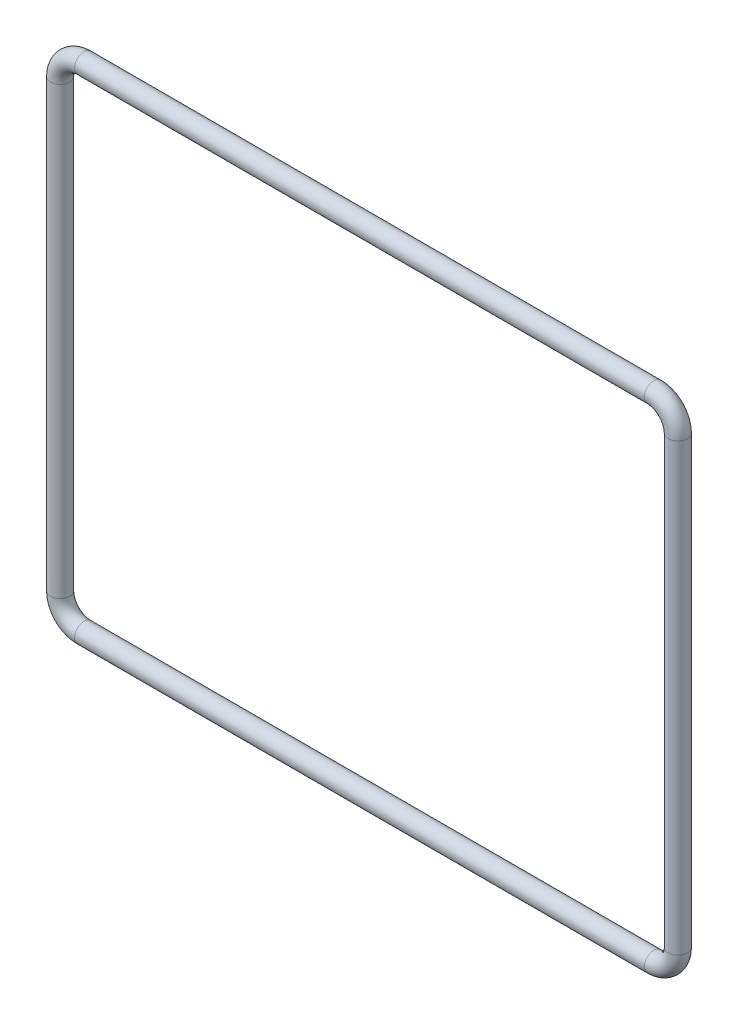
ISO-10303-21;
HEADER;
FILE_DESCRIPTION(('STEP AP214'),'2;1');
FILE_NAME('part.step','',(''),(''),'','','');
FILE_SCHEMA(('AUTOMOTIVE_DESIGN { 1 0 10303 214 1 1 1 1 }'));
ENDSEC;
DATA;
#1=APPLICATION_CONTEXT('core data for automotive mechanical design processes');
#2=APPLICATION_PROTOCOL_DEFINITION('international standard','automotive_design',2000,#1);
#3=PRODUCT_CONTEXT('',#1,'mechanical');
#4=PRODUCT('Part','Part','',(#3));
#5=PRODUCT_RELATED_PRODUCT_CATEGORY('part','',(#4));
#6=PRODUCT_DEFINITION_FORMATION('','',#4);
#7=PRODUCT_DEFINITION_CONTEXT('part definition',#1,'design');
#8=PRODUCT_DEFINITION('design','',#6,#7);
#9=PRODUCT_DEFINITION_SHAPE('','',#8);
#10=(LENGTH_UNIT() NAMED_UNIT(*) SI_UNIT(.MILLI.,.METRE.));
#11=(NAMED_UNIT(*) PLANE_ANGLE_UNIT() SI_UNIT($,.RADIAN.));
#12=(NAMED_UNIT(*) SI_UNIT($,.STERADIAN.) SOLID_ANGLE_UNIT());
#13=UNCERTAINTY_MEASURE_WITH_UNIT(LENGTH_MEASURE(1.E-05),#10,'distance_accuracy_value','');
#14=(GEOMETRIC_REPRESENTATION_CONTEXT(3) GLOBAL_UNCERTAINTY_ASSIGNED_CONTEXT((#13)) GLOBAL_UNIT_ASSIGNED_CONTEXT((#10,
#11,#12)) REPRESENTATION_CONTEXT('',''));
#15=CARTESIAN_POINT('',(0.,0.,0.));
#16=DIRECTION('',(0.,0.,1.));
#17=DIRECTION('',(1.,0.,0.));
#18=AXIS2_PLACEMENT_3D('',#15,#16,#17);
#19=CARTESIAN_POINT('',(0.,-107.,-23.));
#20=DIRECTION('',(-1.,0.,0.));
#21=DIRECTION('',(0.,0.,1.));
#22=AXIS2_PLACEMENT_3D('',#19,#20,#21);
#23=CYLINDRICAL_SURFACE('',#22,2.);
#24=CARTESIAN_POINT('',(-59.5,-107.,-23.));
#25=DIRECTION('',(-1.,0.,0.));
#26=DIRECTION('',(0.,-1.,0.));
#27=AXIS2_PLACEMENT_3D('',#24,#25,#26);
#28=CIRCLE('',#27,2.);
#29=CARTESIAN_POINT('',(-59.5,-109.,-23.));
#30=VERTEX_POINT('',#29);
#31=EDGE_CURVE('E69',#30,#30,#28,.T.);
#32=ORIENTED_EDGE('',*,*,#31,.F.);
#33=EDGE_LOOP('',(#32));
#34=FACE_BOUND('',#33,.T.);
#35=CARTESIAN_POINT('',(59.5,-107.,-23.));
#36=DIRECTION('',(-1.,0.,0.));
#37=DIRECTION('',(0.,-1.,0.));
#38=AXIS2_PLACEMENT_3D('',#35,#36,#37);
#39=CIRCLE('',#38,2.);
#40=CARTESIAN_POINT('',(59.5,-109.,-23.));
#41=VERTEX_POINT('',#40);
#42=EDGE_CURVE('E86',#41,#41,#39,.F.);
#43=ORIENTED_EDGE('',*,*,#42,.F.);
#44=EDGE_LOOP('',(#43));
#45=FACE_BOUND('',#44,.T.);
#46=ADVANCED_FACE('F14',(#34,#45),#23,.T.);
#47=CARTESIAN_POINT('',(59.5,-102.,-23.));
#48=DIRECTION('',(0.,0.,-1.));
#49=DIRECTION('',(-1.,0.,0.));
#50=AXIS2_PLACEMENT_3D('',#47,#48,#49);
#51=TOROIDAL_SURFACE('',#50,5.,2.);
#52=CARTESIAN_POINT('',(64.5,-102.,-23.));
#53=DIRECTION('',(0.,1.,0.));
#54=DIRECTION('',(0.,0.,1.));
#55=AXIS2_PLACEMENT_3D('',#52,#53,#54);
#56=CIRCLE('',#55,2.);
#57=CARTESIAN_POINT('',(64.5,-102.,-21.));
#58=VERTEX_POINT('',#57);
#59=EDGE_CURVE('E63',#58,#58,#56,.T.);
#60=ORIENTED_EDGE('',*,*,#59,.F.);
#61=EDGE_LOOP('',(#60));
#62=FACE_BOUND('',#61,.T.);
#63=ORIENTED_EDGE('',*,*,#42,.T.);
#64=EDGE_LOOP('',(#63));
#65=FACE_BOUND('',#64,.T.);
#66=ADVANCED_FACE('F79',(#62,#65),#51,.T.);
#67=CARTESIAN_POINT('',(-59.5,-102.,-23.));
#68=DIRECTION('',(0.,0.,-1.));
#69=DIRECTION('',(-1.,0.,0.));
#70=AXIS2_PLACEMENT_3D('',#67,#68,#69);
#71=TOROIDAL_SURFACE('',#70,5.,2.);
#72=ORIENTED_EDGE('',*,*,#31,.T.);
#73=EDGE_LOOP('',(#72));
#74=FACE_BOUND('',#73,.T.);
#75=CARTESIAN_POINT('',(-64.5,-102.,-23.));
#76=DIRECTION('',(0.,1.,0.));
#77=DIRECTION('',(0.,0.,1.));
#78=AXIS2_PLACEMENT_3D('',#75,#76,#77);
#79=CIRCLE('',#78,2.);
#80=CARTESIAN_POINT('',(-64.5,-102.,-21.));
#81=VERTEX_POINT('',#80);
#82=EDGE_CURVE('E58',#81,#81,#79,.T.);
#83=ORIENTED_EDGE('',*,*,#82,.F.);
#84=EDGE_LOOP('',(#83));
#85=FACE_BOUND('',#84,.T.);
#86=ADVANCED_FACE('F76',(#74,#85),#71,.T.);
#87=CARTESIAN_POINT('',(64.5,-55.5,-23.));
#88=DIRECTION('',(0.,1.,0.));
#89=DIRECTION('',(0.,0.,1.));
#90=AXIS2_PLACEMENT_3D('',#87,#88,#89);
#91=CYLINDRICAL_SURFACE('',#90,2.);
#92=CARTESIAN_POINT('',(64.5,-9.,-23.));
#93=DIRECTION('',(0.,-1.,0.));
#94=DIRECTION('',(1.,0.,0.));
#95=AXIS2_PLACEMENT_3D('',#92,#93,#94);
#96=CIRCLE('',#95,2.);
#97=CARTESIAN_POINT('',(66.5,-9.,-23.));
#98=VERTEX_POINT('',#97);
#99=EDGE_CURVE('E54',#98,#98,#96,.F.);
#100=ORIENTED_EDGE('',*,*,#99,.F.);
#101=EDGE_LOOP('',(#100));
#102=FACE_BOUND('',#101,.T.);
#103=ORIENTED_EDGE('',*,*,#59,.T.);
#104=EDGE_LOOP('',(#103));
#105=FACE_BOUND('',#104,.T.);
#106=ADVANCED_FACE('F78',(#102,#105),#91,.T.);
#107=CARTESIAN_POINT('',(-64.5,-55.5,-23.));
#108=DIRECTION('',(0.,1.,0.));
#109=DIRECTION('',(0.,0.,1.));
#110=AXIS2_PLACEMENT_3D('',#107,#108,#109);
#111=CYLINDRICAL_SURFACE('',#110,2.);
#112=CARTESIAN_POINT('',(-64.5,-9.,-23.));
#113=DIRECTION('',(0.,1.,0.));
#114=DIRECTION('',(-1.,0.,0.));
#115=AXIS2_PLACEMENT_3D('',#112,#113,#114);
#116=CIRCLE('',#115,2.);
#117=CARTESIAN_POINT('',(-66.5,-9.,-23.));
#118=VERTEX_POINT('',#117);
#119=EDGE_CURVE('E27',#118,#118,#116,.T.);
#120=ORIENTED_EDGE('',*,*,#119,.F.);
#121=EDGE_LOOP('',(#120));
#122=FACE_BOUND('',#121,.T.);
#123=ORIENTED_EDGE('',*,*,#82,.T.);
#124=EDGE_LOOP('',(#123));
#125=FACE_BOUND('',#124,.T.);
#126=ADVANCED_FACE('F48',(#122,#125),#111,.T.);
#127=CARTESIAN_POINT('',(59.5,-9.,-23.));
#128=DIRECTION('',(0.,0.,-1.));
#129=DIRECTION('',(-1.,0.,0.));
#130=AXIS2_PLACEMENT_3D('',#127,#128,#129);
#131=TOROIDAL_SURFACE('',#130,5.,2.);
#132=CARTESIAN_POINT('',(59.5,-4.,-23.));
#133=DIRECTION('',(-1.,0.,0.));
#134=DIRECTION('',(0.,0.,1.));
#135=AXIS2_PLACEMENT_3D('',#132,#133,#134);
#136=CIRCLE('',#135,2.);
#137=CARTESIAN_POINT('',(59.5,-4.,-21.));
#138=VERTEX_POINT('',#137);
#139=EDGE_CURVE('E21',#138,#138,#136,.T.);
#140=ORIENTED_EDGE('',*,*,#139,.F.);
#141=EDGE_LOOP('',(#140));
#142=FACE_BOUND('',#141,.T.);
#143=ORIENTED_EDGE('',*,*,#99,.T.);
#144=EDGE_LOOP('',(#143));
#145=FACE_BOUND('',#144,.T.);
#146=ADVANCED_FACE('F43',(#142,#145),#131,.T.);
#147=CARTESIAN_POINT('',(-59.5,-9.,-23.));
#148=DIRECTION('',(0.,0.,-1.));
#149=DIRECTION('',(-1.,0.,0.));
#150=AXIS2_PLACEMENT_3D('',#147,#148,#149);
#151=TOROIDAL_SURFACE('',#150,5.,2.);
#152=ORIENTED_EDGE('',*,*,#119,.T.);
#153=EDGE_LOOP('',(#152));
#154=FACE_BOUND('',#153,.T.);
#155=CARTESIAN_POINT('',(-59.5,-4.,-23.));
#156=DIRECTION('',(-1.,0.,0.));
#157=DIRECTION('',(0.,0.,1.));
#158=AXIS2_PLACEMENT_3D('',#155,#156,#157);
#159=CIRCLE('',#158,2.);
#160=CARTESIAN_POINT('',(-59.5,-4.,-21.));
#161=VERTEX_POINT('',#160);
#162=EDGE_CURVE('E10',#161,#161,#159,.F.);
#163=ORIENTED_EDGE('',*,*,#162,.F.);
#164=EDGE_LOOP('',(#163));
#165=FACE_BOUND('',#164,.T.);
#166=ADVANCED_FACE('F38',(#154,#165),#151,.T.);
#167=CARTESIAN_POINT('',(0.,-4.,-23.));
#168=DIRECTION('',(-1.,0.,0.));
#169=DIRECTION('',(0.,0.,1.));
#170=AXIS2_PLACEMENT_3D('',#167,#168,#169);
#171=CYLINDRICAL_SURFACE('',#170,2.);
#172=ORIENTED_EDGE('',*,*,#162,.T.);
#173=EDGE_LOOP('',(#172));
#174=FACE_BOUND('',#173,.T.);
#175=ORIENTED_EDGE('',*,*,#139,.T.);
#176=EDGE_LOOP('',(#175));
#177=FACE_BOUND('',#176,.T.);
#178=ADVANCED_FACE('F42',(#174,#177),#171,.T.);
#179=CLOSED_SHELL('',(#46,#66,#86,#106,#126,#146,#166,#178));
#180=MANIFOLD_SOLID_BREP('B1',#179);
#181=ADVANCED_BREP_SHAPE_REPRESENTATION('',(#18,#180),#14);
#182=SHAPE_DEFINITION_REPRESENTATION(#9,#181);
ENDSEC;
END-ISO-10303-21;
